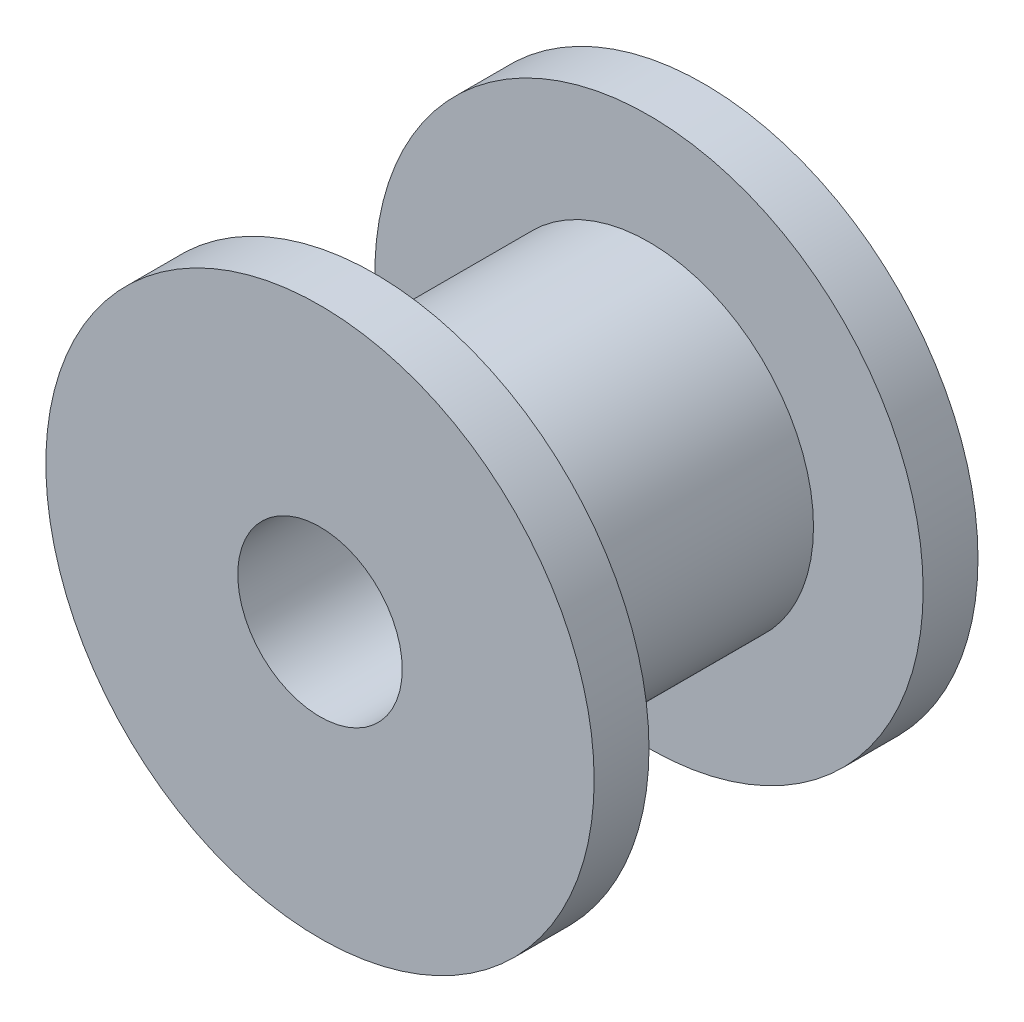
ISO-10303-21;
HEADER;
FILE_DESCRIPTION(('STEP AP214'),'2;1');
FILE_NAME('part.step','',(''),(''),'','','');
FILE_SCHEMA(('AUTOMOTIVE_DESIGN { 1 0 10303 214 1 1 1 1 }'));
ENDSEC;
DATA;
#1=APPLICATION_CONTEXT('core data for automotive mechanical design processes');
#2=APPLICATION_PROTOCOL_DEFINITION('international standard','automotive_design',2000,#1);
#3=PRODUCT_CONTEXT('',#1,'mechanical');
#4=PRODUCT('Part','Part','',(#3));
#5=PRODUCT_RELATED_PRODUCT_CATEGORY('part','',(#4));
#6=PRODUCT_DEFINITION_FORMATION('','',#4);
#7=PRODUCT_DEFINITION_CONTEXT('part definition',#1,'design');
#8=PRODUCT_DEFINITION('design','',#6,#7);
#9=PRODUCT_DEFINITION_SHAPE('','',#8);
#10=(LENGTH_UNIT() NAMED_UNIT(*) SI_UNIT(.MILLI.,.METRE.));
#11=(NAMED_UNIT(*) PLANE_ANGLE_UNIT() SI_UNIT($,.RADIAN.));
#12=(NAMED_UNIT(*) SI_UNIT($,.STERADIAN.) SOLID_ANGLE_UNIT());
#13=UNCERTAINTY_MEASURE_WITH_UNIT(LENGTH_MEASURE(1.E-05),#10,'distance_accuracy_value','');
#14=(GEOMETRIC_REPRESENTATION_CONTEXT(3) GLOBAL_UNCERTAINTY_ASSIGNED_CONTEXT((#13)) GLOBAL_UNIT_ASSIGNED_CONTEXT((#10,
#11,#12)) REPRESENTATION_CONTEXT('',''));
#15=CARTESIAN_POINT('',(0.,0.,0.));
#16=DIRECTION('',(0.,0.,1.));
#17=DIRECTION('',(1.,0.,0.));
#18=AXIS2_PLACEMENT_3D('',#15,#16,#17);
#19=CARTESIAN_POINT('',(0.,0.,2.));
#20=DIRECTION('',(0.,0.,1.));
#21=DIRECTION('',(1.,0.,0.));
#22=AXIS2_PLACEMENT_3D('',#19,#20,#21);
#23=PLANE('',#22);
#24=CARTESIAN_POINT('',(0.,0.,2.));
#25=DIRECTION('',(0.,0.,1.));
#26=DIRECTION('',(1.,0.,0.));
#27=AXIS2_PLACEMENT_3D('',#24,#25,#26);
#28=CIRCLE('',#27,10.);
#29=CARTESIAN_POINT('',(10.,0.,2.));
#30=VERTEX_POINT('',#29);
#31=EDGE_CURVE('E10',#30,#30,#28,.T.);
#32=ORIENTED_EDGE('',*,*,#31,.T.);
#33=EDGE_LOOP('',(#32));
#34=FACE_BOUND('',#33,.T.);
#35=CARTESIAN_POINT('',(0.,0.,2.));
#36=DIRECTION('',(0.,0.,1.));
#37=DIRECTION('',(1.,0.,0.));
#38=AXIS2_PLACEMENT_3D('',#35,#36,#37);
#39=CIRCLE('',#38,6.);
#40=CARTESIAN_POINT('',(6.,0.,2.));
#41=VERTEX_POINT('',#40);
#42=EDGE_CURVE('E42',#41,#41,#39,.T.);
#43=ORIENTED_EDGE('',*,*,#42,.F.);
#44=EDGE_LOOP('',(#43));
#45=FACE_BOUND('',#44,.T.);
#46=ADVANCED_FACE('F29',(#34,#45),#23,.T.);
#47=CARTESIAN_POINT('',(0.,0.,2.));
#48=DIRECTION('',(0.,0.,-1.));
#49=DIRECTION('',(-1.,0.,0.));
#50=AXIS2_PLACEMENT_3D('',#47,#48,#49);
#51=CYLINDRICAL_SURFACE('',#50,10.);
#52=ORIENTED_EDGE('',*,*,#31,.F.);
#53=EDGE_LOOP('',(#52));
#54=FACE_BOUND('',#53,.T.);
#55=CARTESIAN_POINT('',(0.,0.,0.));
#56=DIRECTION('',(0.,0.,1.));
#57=DIRECTION('',(1.,0.,0.));
#58=AXIS2_PLACEMENT_3D('',#55,#56,#57);
#59=CIRCLE('',#58,10.);
#60=CARTESIAN_POINT('',(10.,0.,0.));
#61=VERTEX_POINT('',#60);
#62=EDGE_CURVE('E33',#61,#61,#59,.T.);
#63=ORIENTED_EDGE('',*,*,#62,.T.);
#64=EDGE_LOOP('',(#63));
#65=FACE_BOUND('',#64,.T.);
#66=ADVANCED_FACE('F31',(#54,#65),#51,.T.);
#67=CARTESIAN_POINT('',(0.,0.,0.));
#68=DIRECTION('',(0.,0.,1.));
#69=DIRECTION('',(1.,0.,0.));
#70=AXIS2_PLACEMENT_3D('',#67,#68,#69);
#71=PLANE('',#70);
#72=CARTESIAN_POINT('',(0.,0.,0.));
#73=DIRECTION('',(0.,0.,1.));
#74=DIRECTION('',(1.,0.,0.));
#75=AXIS2_PLACEMENT_3D('',#72,#73,#74);
#76=CIRCLE('',#75,3.);
#77=CARTESIAN_POINT('',(3.,0.,0.));
#78=VERTEX_POINT('',#77);
#79=EDGE_CURVE('E51',#78,#78,#76,.T.);
#80=ORIENTED_EDGE('',*,*,#79,.T.);
#81=EDGE_LOOP('',(#80));
#82=FACE_BOUND('',#81,.T.);
#83=ORIENTED_EDGE('',*,*,#62,.F.);
#84=EDGE_LOOP('',(#83));
#85=FACE_BOUND('',#84,.T.);
#86=ADVANCED_FACE('F84',(#82,#85),#71,.F.);
#87=CARTESIAN_POINT('',(0.,0.,12.));
#88=DIRECTION('',(0.,0.,-1.));
#89=DIRECTION('',(-1.,0.,0.));
#90=AXIS2_PLACEMENT_3D('',#87,#88,#89);
#91=CYLINDRICAL_SURFACE('',#90,6.);
#92=CARTESIAN_POINT('',(0.,0.,12.));
#93=DIRECTION('',(0.,0.,1.));
#94=DIRECTION('',(1.,0.,0.));
#95=AXIS2_PLACEMENT_3D('',#92,#93,#94);
#96=CIRCLE('',#95,6.);
#97=CARTESIAN_POINT('',(6.,0.,12.));
#98=VERTEX_POINT('',#97);
#99=EDGE_CURVE('E40',#98,#98,#96,.T.);
#100=ORIENTED_EDGE('',*,*,#99,.F.);
#101=EDGE_LOOP('',(#100));
#102=FACE_BOUND('',#101,.T.);
#103=ORIENTED_EDGE('',*,*,#42,.T.);
#104=EDGE_LOOP('',(#103));
#105=FACE_BOUND('',#104,.T.);
#106=ADVANCED_FACE('F78',(#102,#105),#91,.T.);
#107=CARTESIAN_POINT('',(0.,0.,12.));
#108=DIRECTION('',(0.,0.,1.));
#109=DIRECTION('',(1.,0.,0.));
#110=AXIS2_PLACEMENT_3D('',#107,#108,#109);
#111=PLANE('',#110);
#112=CARTESIAN_POINT('',(0.,0.,12.));
#113=DIRECTION('',(0.,0.,1.));
#114=DIRECTION('',(1.,0.,0.));
#115=AXIS2_PLACEMENT_3D('',#112,#113,#114);
#116=CIRCLE('',#115,10.);
#117=CARTESIAN_POINT('',(10.,0.,12.));
#118=VERTEX_POINT('',#117);
#119=EDGE_CURVE('E48',#118,#118,#116,.T.);
#120=ORIENTED_EDGE('',*,*,#119,.F.);
#121=EDGE_LOOP('',(#120));
#122=FACE_BOUND('',#121,.T.);
#123=ORIENTED_EDGE('',*,*,#99,.T.);
#124=EDGE_LOOP('',(#123));
#125=FACE_BOUND('',#124,.T.);
#126=ADVANCED_FACE('F72',(#122,#125),#111,.F.);
#127=CARTESIAN_POINT('',(0.,0.,14.));
#128=DIRECTION('',(0.,0.,-1.));
#129=DIRECTION('',(-1.,0.,0.));
#130=AXIS2_PLACEMENT_3D('',#127,#128,#129);
#131=CYLINDRICAL_SURFACE('',#130,10.);
#132=CARTESIAN_POINT('',(0.,0.,14.));
#133=DIRECTION('',(0.,0.,1.));
#134=DIRECTION('',(1.,0.,0.));
#135=AXIS2_PLACEMENT_3D('',#132,#133,#134);
#136=CIRCLE('',#135,10.);
#137=CARTESIAN_POINT('',(10.,0.,14.));
#138=VERTEX_POINT('',#137);
#139=EDGE_CURVE('E45',#138,#138,#136,.T.);
#140=ORIENTED_EDGE('',*,*,#139,.F.);
#141=EDGE_LOOP('',(#140));
#142=FACE_BOUND('',#141,.T.);
#143=ORIENTED_EDGE('',*,*,#119,.T.);
#144=EDGE_LOOP('',(#143));
#145=FACE_BOUND('',#144,.T.);
#146=ADVANCED_FACE('F66',(#142,#145),#131,.T.);
#147=CARTESIAN_POINT('',(0.,0.,14.));
#148=DIRECTION('',(0.,0.,1.));
#149=DIRECTION('',(1.,0.,0.));
#150=AXIS2_PLACEMENT_3D('',#147,#148,#149);
#151=PLANE('',#150);
#152=CARTESIAN_POINT('',(0.,0.,14.));
#153=DIRECTION('',(0.,0.,1.));
#154=DIRECTION('',(1.,0.,0.));
#155=AXIS2_PLACEMENT_3D('',#152,#153,#154);
#156=CIRCLE('',#155,3.);
#157=CARTESIAN_POINT('',(3.,0.,14.));
#158=VERTEX_POINT('',#157);
#159=EDGE_CURVE('E56',#158,#158,#156,.T.);
#160=ORIENTED_EDGE('',*,*,#159,.F.);
#161=EDGE_LOOP('',(#160));
#162=FACE_BOUND('',#161,.T.);
#163=ORIENTED_EDGE('',*,*,#139,.T.);
#164=EDGE_LOOP('',(#163));
#165=FACE_BOUND('',#164,.T.);
#166=ADVANCED_FACE('F63',(#162,#165),#151,.T.);
#167=CARTESIAN_POINT('',(0.,0.,-11.));
#168=DIRECTION('',(0.,0.,1.));
#169=DIRECTION('',(1.,0.,0.));
#170=AXIS2_PLACEMENT_3D('',#167,#168,#169);
#171=CYLINDRICAL_SURFACE('',#170,3.);
#172=ORIENTED_EDGE('',*,*,#159,.T.);
#173=EDGE_LOOP('',(#172));
#174=FACE_BOUND('',#173,.T.);
#175=ORIENTED_EDGE('',*,*,#79,.F.);
#176=EDGE_LOOP('',(#175));
#177=FACE_BOUND('',#176,.T.);
#178=ADVANCED_FACE('F60',(#174,#177),#171,.F.);
#179=CLOSED_SHELL('',(#46,#66,#86,#106,#126,#146,#166,#178));
#180=MANIFOLD_SOLID_BREP('B2',#179);
#181=ADVANCED_BREP_SHAPE_REPRESENTATION('',(#18,#180),#14);
#182=SHAPE_DEFINITION_REPRESENTATION(#9,#181);
ENDSEC;
END-ISO-10303-21;
